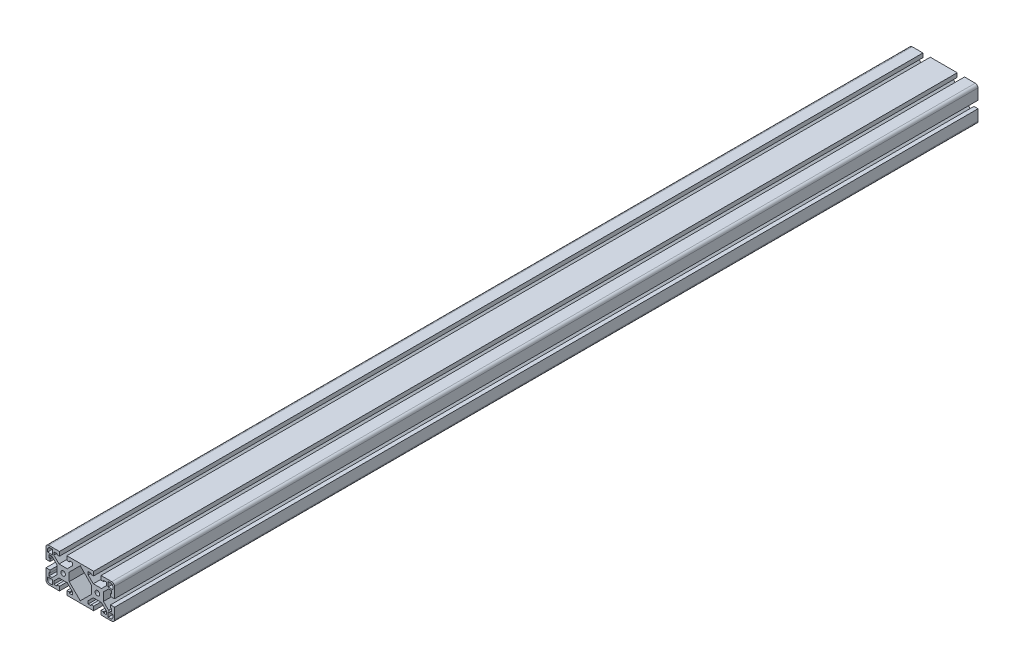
from build123d import *

# Parameters (mm, degrees)
SKETCH1_R           = 2.5527
BOSS_EXTRUDE1_DEPTH = 480.1235


with BuildPart() as part:
    # Sketch1 → Boss-Extrude1 (new, symmetric)
    with BuildSketch(Plane.XY):
        with BuildLine():
            Line((-29.337, 12.442261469), (-29.337, 15.6718))
            Line((-29.337, 15.6718), (-25.908, 15.6718))
            Line((-25.908, 15.6718), (-25.908, 14.5034))
            Line((-25.908, 14.5034), (-23.114, 14.5034))
            Line((-23.114, 14.5034), (-23.114, 19.05))
            Line((-23.114, 19.05), (-35.052, 19.05))
            ThreePointArc((-35.052, 19.05), (-37.207261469, 18.157261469), (-38.1, 16.002))
            Line((-38.1, 16.002), (-38.1, 4.064))
            Line((-38.1, 4.064), (-33.5534, 4.064))
            Line((-33.5534, 4.064), (-33.5534, 6.858))
            Line((-33.5534, 6.858), (-34.7218, 6.858))
            Line((-34.7218, 6.858), (-34.7218, 10.287))
            Line((-34.7218, 10.287), (-31.492261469, 10.287))
            Line((-31.492261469, 10.287), (-25.781, 4.575738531))
            Line((-25.781, 4.575738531), (-25.781, -4.575738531))
            Line((-25.781, -4.575738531), (-31.492261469, -10.287))
            Line((-31.492261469, -10.287), (-34.7218, -10.287))
            Line((-34.7218, -10.287), (-34.7218, -6.858))
            Line((-34.7218, -6.858), (-33.5534, -6.858))
            Line((-33.5534, -6.858), (-33.5534, -4.064))
            Line((-33.5534, -4.064), (-38.1, -4.064))
            Line((-38.1, -4.064), (-38.1, -16.002))
            ThreePointArc((-38.1, -16.002), (-37.207261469, -18.157261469), (-35.052, -19.05))
            Line((-35.052, -19.05), (-23.114, -19.05))
            Line((-23.114, -19.05), (-23.114, -14.5034))
            Line((-23.114, -14.5034), (-25.908, -14.5034))
            Line((-25.908, -14.5034), (-25.908, -15.6718))
            Line((-25.908, -15.6718), (-29.337, -15.6718))
            Line((-29.337, -15.6718), (-29.337, -12.442261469))
            Line((-29.337, -12.442261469), (-23.625738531, -6.731))
            Line((-23.625738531, -6.731), (-14.474261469, -6.731))
            Line((-14.474261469, -6.731), (-8.763, -12.442261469))
            Line((-8.763, -12.442261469), (-8.763, -15.6718))
            Line((-8.763, -15.6718), (-12.192, -15.6718))
            Line((-12.192, -15.6718), (-12.192, -14.5034))
            Line((-12.192, -14.5034), (-14.986, -14.5034))
            Line((-14.986, -14.5034), (-14.986, -19.05))
            Line((-14.986, -19.05), (14.986, -19.05))
            Line((14.986, -19.05), (14.986, -14.5034))
            Line((14.986, -14.5034), (12.192, -14.5034))
            Line((12.192, -14.5034), (12.192, -15.6718))
            Line((12.192, -15.6718), (8.763, -15.6718))
            Line((8.763, -15.6718), (8.763, -12.442261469))
            Line((8.763, -12.442261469), (14.474261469, -6.731))
            Line((14.474261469, -6.731), (23.625738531, -6.731))
            Line((23.625738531, -6.731), (29.337, -12.442261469))
            Line((29.337, -12.442261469), (29.337, -15.6718))
            Line((29.337, -15.6718), (25.908, -15.6718))
            Line((25.908, -15.6718), (25.908, -14.5034))
            Line((25.908, -14.5034), (23.114, -14.5034))
            Line((23.114, -14.5034), (23.114, -19.05))
            Line((23.114, -19.05), (35.052, -19.05))
            ThreePointArc((35.052, -19.05), (37.207261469, -18.157261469), (38.1, -16.002))
            Line((38.1, -16.002), (38.1, -4.064))
            Line((38.1, -4.064), (33.5534, -4.064))
            Line((33.5534, -4.064), (33.5534, -6.858))
            Line((33.5534, -6.858), (34.7218, -6.858))
            Line((34.7218, -6.858), (34.7218, -10.287))
            Line((34.7218, -10.287), (31.492261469, -10.287))
            Line((31.492261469, -10.287), (25.781, -4.575738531))
            Line((25.781, -4.575738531), (25.781, 4.575738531))
            Line((25.781, 4.575738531), (31.492261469, 10.287))
            Line((31.492261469, 10.287), (34.7218, 10.287))
            Line((34.7218, 10.287), (34.7218, 6.858))
            Line((34.7218, 6.858), (33.5534, 6.858))
            Line((33.5534, 6.858), (33.5534, 4.064))
            Line((33.5534, 4.064), (38.1, 4.064))
            Line((38.1, 4.064), (38.1, 16.002))
            ThreePointArc((38.1, 16.002), (37.207261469, 18.157261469), (35.052, 19.05))
            Line((35.052, 19.05), (23.114, 19.05))
            Line((23.114, 19.05), (23.114, 14.5034))
            Line((23.114, 14.5034), (25.908, 14.5034))
            Line((25.908, 14.5034), (25.908, 15.6718))
            Line((25.908, 15.6718), (29.337, 15.6718))
            Line((29.337, 15.6718), (29.337, 12.442261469))
            Line((29.337, 12.442261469), (23.625738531, 6.731))
            Line((23.625738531, 6.731), (14.474261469, 6.731))
            Line((14.474261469, 6.731), (8.763, 12.442261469))
            Line((8.763, 12.442261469), (8.763, 15.6718))
            Line((8.763, 15.6718), (12.192, 15.6718))
            Line((12.192, 15.6718), (12.192, 14.5034))
            Line((12.192, 14.5034), (14.986, 14.5034))
            Line((14.986, 14.5034), (14.986, 19.05))
            Line((14.986, 19.05), (-14.986, 19.05))
            Line((-14.986, 19.05), (-14.986, 14.5034))
            Line((-14.986, 14.5034), (-12.192, 14.5034))
            Line((-12.192, 14.5034), (-12.192, 15.6718))
            Line((-12.192, 15.6718), (-8.763, 15.6718))
            Line((-8.763, 15.6718), (-8.763, 12.442261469))
            Line((-8.763, 12.442261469), (-14.474261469, 6.731))
            Line((-14.474261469, 6.731), (-23.625738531, 6.731))
            Line((-23.625738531, 6.731), (-29.337, 12.442261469))
        make_face()
        with Locations(Location((-19.05, 0, 0), (0, 0, 180))):
            Circle(SKETCH1_R, mode=Mode.SUBTRACT)
        with Locations(Location((19.05, 0, 0), (0, 0, 180))):
            Circle(SKETCH1_R, mode=Mode.SUBTRACT)
        Polygon((-12.319, 4.575738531), (-12.319, -4.575738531), (0, -16.894738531), (12.319, -4.575738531), (12.319, 4.575738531), (0, 16.894738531), align=None, mode=Mode.SUBTRACT)
        with BuildLine():
            Line((-30.9372, 11.8872), (-30.9372, 17.272))
            Line((-30.9372, 17.272), (-33.528, 17.272))
            ThreePointArc((-33.528, 17.272), (-35.503656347, 16.453656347), (-36.322, 14.478))
            Line((-36.322, 14.478), (-36.322, 11.8872))
            Line((-36.322, 11.8872), (-30.9372, 11.8872))
        make_face(mode=Mode.SUBTRACT)
        with BuildLine():
            Line((-30.9372, -17.272), (-30.9372, -11.8872))
            Line((-30.9372, -11.8872), (-36.322, -11.8872))
            Line((-36.322, -11.8872), (-36.322, -14.478))
            ThreePointArc((-36.322, -14.478), (-35.503656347, -16.453656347), (-33.528, -17.272))
            Line((-33.528, -17.272), (-30.9372, -17.272))
        make_face(mode=Mode.SUBTRACT)
        with BuildLine():
            Line((36.322, -11.8872), (30.9372, -11.8872))
            Line((30.9372, -11.8872), (30.9372, -17.272))
            Line((30.9372, -17.272), (33.528, -17.272))
            ThreePointArc((33.528, -17.272), (35.503656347, -16.453656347), (36.322, -14.478))
            Line((36.322, -14.478), (36.322, -11.8872))
        make_face(mode=Mode.SUBTRACT)
        with BuildLine():
            Line((30.9372, 17.272), (30.9372, 11.8872))
            Line((30.9372, 11.8872), (36.322, 11.8872))
            Line((36.322, 11.8872), (36.322, 14.478))
            ThreePointArc((36.322, 14.478), (35.503656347, 16.453656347), (33.528, 17.272))
            Line((33.528, 17.272), (30.9372, 17.272))
        make_face(mode=Mode.SUBTRACT)
    extrude(amount=BOSS_EXTRUDE1_DEPTH, both=True)


solid = part.part
